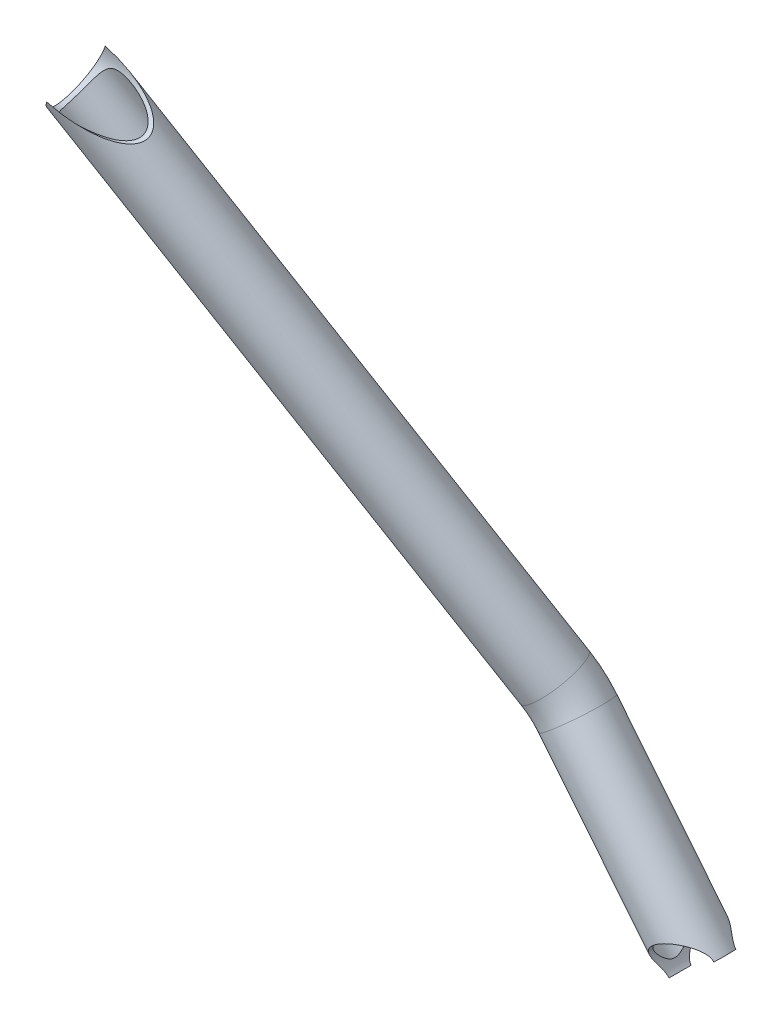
ISO-10303-21;
HEADER;
FILE_DESCRIPTION(('STEP AP214'),'2;1');
FILE_NAME('part.step','',(''),(''),'','','');
FILE_SCHEMA(('AUTOMOTIVE_DESIGN { 1 0 10303 214 1 1 1 1 }'));
ENDSEC;
DATA;
#1=APPLICATION_CONTEXT('core data for automotive mechanical design processes');
#2=APPLICATION_PROTOCOL_DEFINITION('international standard','automotive_design',2000,#1);
#3=PRODUCT_CONTEXT('',#1,'mechanical');
#4=PRODUCT('Part','Part','',(#3));
#5=PRODUCT_RELATED_PRODUCT_CATEGORY('part','',(#4));
#6=PRODUCT_DEFINITION_FORMATION('','',#4);
#7=PRODUCT_DEFINITION_CONTEXT('part definition',#1,'design');
#8=PRODUCT_DEFINITION('design','',#6,#7);
#9=PRODUCT_DEFINITION_SHAPE('','',#8);
#10=(LENGTH_UNIT() NAMED_UNIT(*) SI_UNIT(.MILLI.,.METRE.));
#11=(NAMED_UNIT(*) PLANE_ANGLE_UNIT() SI_UNIT($,.RADIAN.));
#12=(NAMED_UNIT(*) SI_UNIT($,.STERADIAN.) SOLID_ANGLE_UNIT());
#13=UNCERTAINTY_MEASURE_WITH_UNIT(LENGTH_MEASURE(1.E-05),#10,'distance_accuracy_value','');
#14=(GEOMETRIC_REPRESENTATION_CONTEXT(3) GLOBAL_UNCERTAINTY_ASSIGNED_CONTEXT((#13)) GLOBAL_UNIT_ASSIGNED_CONTEXT((#10,
#11,#12)) REPRESENTATION_CONTEXT('',''));
#15=CARTESIAN_POINT('',(0.,0.,0.));
#16=DIRECTION('',(0.,0.,1.));
#17=DIRECTION('',(1.,0.,0.));
#18=AXIS2_PLACEMENT_3D('',#15,#16,#17);
#19=CARTESIAN_POINT('',(-25.7347116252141,-142.314728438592,-164.226280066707));
#20=DIRECTION('',(-0.628585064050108,0.777740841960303,0.));
#21=DIRECTION('',(-0.777740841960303,-0.628585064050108,0.));
#22=AXIS2_PLACEMENT_3D('',#19,#20,#21);
#23=PLANE('',#22);
#24=CARTESIAN_POINT('',(-25.7347116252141,-142.314728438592,-164.226280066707));
#25=DIRECTION('',(-0.628585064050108,0.777740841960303,0.));
#26=DIRECTION('',(-0.777740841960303,-0.628585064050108,0.));
#27=AXIS2_PLACEMENT_3D('',#24,#25,#26);
#28=CIRCLE('',#27,15.);
#29=CARTESIAN_POINT('',(-36.6230834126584,-151.114919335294,-169.611444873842));
#30=VERTEX_POINT('',#29);
#31=CARTESIAN_POINT('',(-36.6230834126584,-151.114919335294,-158.841115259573));
#32=VERTEX_POINT('',#31);
#33=EDGE_CURVE('E104',#30,#32,#28,.T.);
#34=ORIENTED_EDGE('',*,*,#33,.F.);
#35=DIRECTION('',(0.,0.,1.));
#36=VECTOR('',#35,1.);
#37=CARTESIAN_POINT('',(-36.6230834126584,-151.114919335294,-179.226280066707));
#38=LINE('',#37,#36);
#39=EDGE_CURVE('E11',#30,#32,#38,.T.);
#40=ORIENTED_EDGE('',*,*,#39,.T.);
#41=EDGE_LOOP('',(#34,#40));
#42=FACE_BOUND('',#41,.T.);
#43=ADVANCED_FACE('F33',(#42),#23,.F.);
#44=CARTESIAN_POINT('',(-95.7836808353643,-55.6439699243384,-162.363586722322));
#45=DIRECTION('',(-0.609070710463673,0.753595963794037,0.247236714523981));
#46=DIRECTION('',(-0.777740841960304,-0.628585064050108,0.));
#47=AXIS2_PLACEMENT_3D('',#44,#45,#46);
#48=CYLINDRICAL_SURFACE('',#47,15.);
#49=CARTESIAN_POINT('',(-261.734711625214,149.685271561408,-94.9999999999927));
#50=DIRECTION('',(0.442113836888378,0.852264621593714,0.279607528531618));
#51=DIRECTION('',(-0.896958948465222,0.420083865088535,0.137819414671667));
#52=AXIS2_PLACEMENT_3D('',#49,#50,#51);
#53=ELLIPSE('',#52,33.9279134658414,15.);
#54=CARTESIAN_POINT('',(-261.734711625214,145.009346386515,-80.7474309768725));
#55=VERTEX_POINT('',#54);
#56=CARTESIAN_POINT('',(-261.734711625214,154.361196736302,-109.252569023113));
#57=VERTEX_POINT('',#56);
#58=EDGE_CURVE('E47',#55,#57,#53,.T.);
#59=ORIENTED_EDGE('',*,*,#58,.F.);
#60=CARTESIAN_POINT('',(-261.734711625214,149.685271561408,-94.9999999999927));
#61=DIRECTION('',(-0.896958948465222,0.420083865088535,0.137819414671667));
#62=DIRECTION('',(0.442113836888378,0.852264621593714,0.279607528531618));
#63=AXIS2_PLACEMENT_3D('',#60,#61,#62);
#64=ELLIPSE('',#63,16.7231733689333,15.);
#65=EDGE_CURVE('E65',#57,#55,#64,.T.);
#66=ORIENTED_EDGE('',*,*,#65,.F.);
#67=EDGE_LOOP('',(#59,#66));
#68=FACE_BOUND('',#67,.T.);
#69=CARTESIAN_POINT('',(-95.7836808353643,-55.6439699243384,-162.363586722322));
#70=DIRECTION('',(-0.609070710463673,0.753595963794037,0.247236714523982));
#71=DIRECTION('',(-0.777740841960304,-0.628585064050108,0.));
#72=AXIS2_PLACEMENT_3D('',#69,#70,#71);
#73=CIRCLE('',#72,15.);
#74=CARTESIAN_POINT('',(-98.1148204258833,-52.7596785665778,-176.897913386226));
#75=VERTEX_POINT('',#74);
#76=EDGE_CURVE('E156',#75,#75,#73,.T.);
#77=ORIENTED_EDGE('',*,*,#76,.T.);
#78=EDGE_LOOP('',(#77));
#79=FACE_BOUND('',#78,.T.);
#80=ADVANCED_FACE('F35',(#68,#79),#48,.T.);
#81=CARTESIAN_POINT('',(-95.7836808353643,-55.6439699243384,-162.363586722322));
#82=DIRECTION('',(-0.609070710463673,0.753595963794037,0.247236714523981));
#83=DIRECTION('',(-0.777740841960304,-0.628585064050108,0.));
#84=AXIS2_PLACEMENT_3D('',#81,#82,#83);
#85=CYLINDRICAL_SURFACE('',#84,13.);
#86=CARTESIAN_POINT('',(-266.456125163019,134.845650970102,-97.1876153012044));
#87=CARTESIAN_POINT('',(-266.413491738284,134.792905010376,-96.8297945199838));
#88=CARTESIAN_POINT('',(-266.361830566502,134.75325889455,-96.4710366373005));
#89=CARTESIAN_POINT('',(-266.240600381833,134.699945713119,-95.7544647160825));
#90=CARTESIAN_POINT('',(-266.171021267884,134.686293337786,-95.3966513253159));
#91=CARTESIAN_POINT('',(-266.013942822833,134.684358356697,-94.6840637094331));
#92=CARTESIAN_POINT('',(-265.9264034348,134.69613303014,-94.3292981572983));
#93=CARTESIAN_POINT('',(-265.73361641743,134.744146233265,-93.6263669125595));
#94=CARTESIAN_POINT('',(-265.628371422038,134.780381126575,-93.2782002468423));
#95=CARTESIAN_POINT('',(-265.400460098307,134.875783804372,-92.59194144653));
#96=CARTESIAN_POINT('',(-265.277843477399,134.934886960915,-92.2538237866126));
#97=CARTESIAN_POINT('',(-265.014732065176,135.074284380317,-91.5890789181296));
#98=CARTESIAN_POINT('',(-264.874235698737,135.154580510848,-91.2624527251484));
#99=CARTESIAN_POINT('',(-264.574881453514,135.334182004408,-90.6231927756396));
#100=CARTESIAN_POINT('',(-264.416025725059,135.433485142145,-90.3105573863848));
#101=CARTESIAN_POINT('',(-264.079057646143,135.648438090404,-89.7017509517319));
#102=CARTESIAN_POINT('',(-263.900948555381,135.764085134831,-89.4055771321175));
#103=CARTESIAN_POINT('',(-263.555884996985,135.98777237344,-88.8807152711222));
#104=CARTESIAN_POINT('',(-263.392116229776,136.093805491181,-88.6490704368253));
#105=CARTESIAN_POINT('',(-263.049202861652,136.312479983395,-88.2006896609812));
#106=CARTESIAN_POINT('',(-262.870057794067,136.425121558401,-87.9839541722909));
#107=CARTESIAN_POINT('',(-262.495374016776,136.653868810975,-87.5677153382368));
#108=CARTESIAN_POINT('',(-262.299859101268,136.769969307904,-87.368187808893));
#109=CARTESIAN_POINT('',(-261.890853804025,137.002056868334,-86.988413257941));
#110=CARTESIAN_POINT('',(-261.677370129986,137.118043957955,-86.8081590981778));
#111=CARTESIAN_POINT('',(-261.292014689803,137.314394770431,-86.5156910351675));
#112=CARTESIAN_POINT('',(-261.124622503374,137.395865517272,-86.3983075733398));
#113=CARTESIAN_POINT('',(-260.779571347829,137.554278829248,-86.1763050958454));
#114=CARTESIAN_POINT('',(-260.601915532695,137.631222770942,-86.0716821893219));
#115=CARTESIAN_POINT('',(-260.236862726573,137.778331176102,-85.876420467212));
#116=CARTESIAN_POINT('',(-260.04948512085,137.848508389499,-85.7857551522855));
#117=CARTESIAN_POINT('',(-259.66540436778,137.980210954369,-85.6190160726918));
#118=CARTESIAN_POINT('',(-259.468701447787,138.041736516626,-85.5429419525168));
#119=CARTESIAN_POINT('',(-259.06640702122,138.154679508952,-85.4055532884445));
#120=CARTESIAN_POINT('',(-258.860781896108,138.20605375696,-85.3443015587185));
#121=CARTESIAN_POINT('',(-258.443147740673,138.297267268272,-85.2368891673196));
#122=CARTESIAN_POINT('',(-258.231138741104,138.337106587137,-85.1907284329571));
#123=CARTESIAN_POINT('',(-257.80241461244,138.404926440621,-85.1128117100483));
#124=CARTESIAN_POINT('',(-257.585694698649,138.432894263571,-85.0810711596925));
#125=CARTESIAN_POINT('',(-257.149562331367,138.477257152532,-85.0309725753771));
#126=CARTESIAN_POINT('',(-256.930149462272,138.493650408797,-85.0126166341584));
#127=CARTESIAN_POINT('',(-256.390030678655,138.520719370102,-84.9823433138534));
#128=CARTESIAN_POINT('',(-256.068645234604,138.525402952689,-84.9771520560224));
#129=CARTESIAN_POINT('',(-255.426547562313,138.515657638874,-84.9880230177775));
#130=CARTESIAN_POINT('',(-255.105835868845,138.501217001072,-85.0040982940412));
#131=CARTESIAN_POINT('',(-254.465541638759,138.456923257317,-85.053880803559));
#132=CARTESIAN_POINT('',(-254.145970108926,138.427003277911,-85.0876645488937));
#133=CARTESIAN_POINT('',(-253.510241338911,138.355109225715,-85.1699241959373));
#134=CARTESIAN_POINT('',(-253.1940834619,138.313137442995,-85.2183973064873));
#135=CARTESIAN_POINT('',(-252.448232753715,138.202601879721,-85.3481613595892));
#136=CARTESIAN_POINT('',(-252.0201126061,138.129956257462,-85.4349511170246));
#137=CARTESIAN_POINT('',(-251.170409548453,137.972825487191,-85.6280142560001));
#138=CARTESIAN_POINT('',(-250.748829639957,137.888335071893,-85.7342963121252));
#139=CARTESIAN_POINT('',(-249.911307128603,137.711428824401,-85.964062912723));
#140=CARTESIAN_POINT('',(-249.495375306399,137.618999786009,-86.0875763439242));
#141=CARTESIAN_POINT('',(-248.669649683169,137.429404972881,-86.3501463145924));
#142=CARTESIAN_POINT('',(-248.259854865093,137.33223999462,-86.4892002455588));
#143=CARTESIAN_POINT('',(-247.445634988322,137.135387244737,-86.782237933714));
#144=CARTESIAN_POINT('',(-247.04121753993,137.035696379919,-86.9362407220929));
#145=CARTESIAN_POINT('',(-246.238280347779,136.835827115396,-87.258696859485));
#146=CARTESIAN_POINT('',(-245.839760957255,136.735648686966,-87.427151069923));
#147=CARTESIAN_POINT('',(-245.049317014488,136.536573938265,-87.7783341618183));
#148=CARTESIAN_POINT('',(-244.657385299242,136.437676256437,-87.9610461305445));
#149=CARTESIAN_POINT('',(-243.880120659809,136.242554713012,-88.3412446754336));
#150=CARTESIAN_POINT('',(-243.494787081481,136.146330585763,-88.5387297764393));
#151=CARTESIAN_POINT('',(-242.675917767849,135.944326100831,-88.9789274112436));
#152=CARTESIAN_POINT('',(-242.243509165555,135.839187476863,-89.224042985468));
#153=CARTESIAN_POINT('',(-241.389683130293,135.636588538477,-89.735940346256));
#154=CARTESIAN_POINT('',(-240.968267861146,135.539129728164,-90.0027263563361));
#155=CARTESIAN_POINT('',(-240.139727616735,135.354695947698,-90.5592355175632));
#156=CARTESIAN_POINT('',(-239.732574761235,135.267699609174,-90.8489098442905));
#157=CARTESIAN_POINT('',(-238.935143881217,135.107069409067,-91.4540073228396));
#158=CARTESIAN_POINT('',(-238.544859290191,135.033430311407,-91.769420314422));
#159=CARTESIAN_POINT('',(-237.915615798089,134.925618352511,-92.3164242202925));
#160=CARTESIAN_POINT('',(-237.67044623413,134.886551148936,-92.5399119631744));
#161=CARTESIAN_POINT('',(-237.191599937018,134.81733519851,-93.0003261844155));
#162=CARTESIAN_POINT('',(-236.957924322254,134.787187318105,-93.2372539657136));
#163=CARTESIAN_POINT('',(-236.504953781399,134.737529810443,-93.7252024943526));
#164=CARTESIAN_POINT('',(-236.285645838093,134.718010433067,-93.9762100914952));
#165=CARTESIAN_POINT('',(-235.864680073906,134.691600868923,-94.4932460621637));
#166=CARTESIAN_POINT('',(-235.663014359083,134.684705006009,-94.7592676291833));
#167=CARTESIAN_POINT('',(-235.345177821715,134.685710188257,-95.2156803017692));
#168=CARTESIAN_POINT('',(-235.222871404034,134.689454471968,-95.4018164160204));
#169=CARTESIAN_POINT('',(-234.989692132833,134.704412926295,-95.7809399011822));
#170=CARTESIAN_POINT('',(-234.878821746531,134.71562870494,-95.9739287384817));
#171=CARTESIAN_POINT('',(-234.670523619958,134.7463192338,-96.3661426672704));
#172=CARTESIAN_POINT('',(-234.573080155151,134.765784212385,-96.5653601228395));
#173=CARTESIAN_POINT('',(-234.39355576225,134.813736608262,-96.9694652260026));
#174=CARTESIAN_POINT('',(-234.311465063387,134.842218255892,-97.1743491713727));
#175=CARTESIAN_POINT('',(-234.177976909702,134.902813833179,-97.5511707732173));
#176=CARTESIAN_POINT('',(-234.123713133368,134.933334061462,-97.7223501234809));
#177=CARTESIAN_POINT('',(-234.027943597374,135.00109330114,-98.0668716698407));
#178=CARTESIAN_POINT('',(-233.98643167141,135.038329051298,-98.2402127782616));
#179=CARTESIAN_POINT('',(-233.917093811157,135.119611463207,-98.5879530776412));
#180=CARTESIAN_POINT('',(-233.889260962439,135.163654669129,-98.7623516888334));
#181=CARTESIAN_POINT('',(-233.847939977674,135.258488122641,-99.1110286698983));
#182=CARTESIAN_POINT('',(-233.834451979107,135.309278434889,-99.2853070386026));
#183=CARTESIAN_POINT('',(-233.822160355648,135.417469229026,-99.6328195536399));
#184=CARTESIAN_POINT('',(-233.823394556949,135.47488636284,-99.8060498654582));
#185=CARTESIAN_POINT('',(-233.840605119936,135.595757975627,-100.149638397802));
#186=CARTESIAN_POINT('',(-233.856581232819,135.659212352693,-100.319996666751));
#187=CARTESIAN_POINT('',(-233.902869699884,135.791581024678,-100.656686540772));
#188=CARTESIAN_POINT('',(-233.933189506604,135.860498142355,-100.823016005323));
#189=CARTESIAN_POINT('',(-234.007422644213,136.003066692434,-101.150544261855));
#190=CARTESIAN_POINT('',(-234.051338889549,136.076719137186,-101.311741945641));
#191=CARTESIAN_POINT('',(-234.162585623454,136.244274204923,-101.662203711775));
#192=CARTESIAN_POINT('',(-234.232918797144,136.339129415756,-101.850062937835));
#193=CARTESIAN_POINT('',(-234.390186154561,136.533450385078,-102.216135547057));
#194=CARTESIAN_POINT('',(-234.477123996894,136.632917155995,-102.394346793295));
#195=CARTESIAN_POINT('',(-234.760018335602,136.936805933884,-102.914408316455));
#196=CARTESIAN_POINT('',(-234.977948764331,137.146561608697,-103.241368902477));
#197=CARTESIAN_POINT('',(-235.403943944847,137.525616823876,-103.787942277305));
#198=CARTESIAN_POINT('',(-235.603570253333,137.693627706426,-104.015320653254));
#199=CARTESIAN_POINT('',(-236.02374873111,138.031796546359,-104.448383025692));
#200=CARTESIAN_POINT('',(-236.244313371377,138.201955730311,-104.654053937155));
#201=CARTESIAN_POINT('',(-236.70228989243,138.543021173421,-105.045787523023));
#202=CARTESIAN_POINT('',(-236.939727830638,138.713928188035,-105.231818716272));
#203=CARTESIAN_POINT('',(-237.428000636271,139.055269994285,-105.586007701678));
#204=CARTESIAN_POINT('',(-237.678840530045,139.225704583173,-105.754158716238));
#205=CARTESIAN_POINT('',(-238.178398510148,139.556708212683,-106.066222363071));
#206=CARTESIAN_POINT('',(-238.426581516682,139.717340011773,-106.210930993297));
#207=CARTESIAN_POINT('',(-238.931092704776,140.036982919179,-106.487172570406));
#208=CARTESIAN_POINT('',(-239.187419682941,140.195994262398,-106.618707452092));
#209=CARTESIAN_POINT('',(-239.707246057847,140.512204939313,-106.869947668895));
#210=CARTESIAN_POINT('',(-239.970751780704,140.669402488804,-106.989642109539));
#211=CARTESIAN_POINT('',(-240.503753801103,140.981543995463,-107.218123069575));
#212=CARTESIAN_POINT('',(-240.773250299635,141.136487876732,-107.326909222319));
#213=CARTESIAN_POINT('',(-241.318263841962,141.444294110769,-107.534786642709));
#214=CARTESIAN_POINT('',(-241.593796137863,141.597149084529,-107.633848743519));
#215=CARTESIAN_POINT('',(-242.149550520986,141.900062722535,-107.822729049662));
#216=CARTESIAN_POINT('',(-242.429773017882,142.050121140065,-107.91254644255));
#217=CARTESIAN_POINT('',(-242.994281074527,142.347075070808,-108.083585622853));
#218=CARTESIAN_POINT('',(-243.27856447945,142.493972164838,-108.164811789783));
#219=CARTESIAN_POINT('',(-243.850991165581,142.784380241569,-108.319337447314));
#220=CARTESIAN_POINT('',(-244.139134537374,142.927891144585,-108.392636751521));
#221=CARTESIAN_POINT('',(-244.757539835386,143.229993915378,-108.54109871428));
#222=CARTESIAN_POINT('',(-245.08831170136,143.388056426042,-108.615215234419));
#223=CARTESIAN_POINT('',(-245.754219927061,143.698776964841,-108.754667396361));
#224=CARTESIAN_POINT('',(-246.08935637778,143.851434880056,-108.820002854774));
#225=CARTESIAN_POINT('',(-246.764070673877,144.150681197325,-108.942541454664));
#226=CARTESIAN_POINT('',(-247.103651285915,144.297265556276,-108.999739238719));
#227=CARTESIAN_POINT('',(-247.786993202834,144.583285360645,-109.106488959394));
#228=CARTESIAN_POINT('',(-248.130754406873,144.722720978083,-109.156041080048));
#229=CARTESIAN_POINT('',(-248.821498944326,144.992789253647,-109.247837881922));
#230=CARTESIAN_POINT('',(-249.168469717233,145.123446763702,-109.290103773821));
#231=CARTESIAN_POINT('',(-249.866807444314,145.374782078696,-109.367914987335));
#232=CARTESIAN_POINT('',(-250.218174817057,145.495458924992,-109.403459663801));
#233=CARTESIAN_POINT('',(-250.925092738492,145.724506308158,-109.468119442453));
#234=CARTESIAN_POINT('',(-251.280638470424,145.832889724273,-109.497241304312));
#235=CARTESIAN_POINT('',(-251.99639282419,146.034534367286,-109.549328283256));
#236=CARTESIAN_POINT('',(-252.356600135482,146.127799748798,-109.572295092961));
#237=CARTESIAN_POINT('',(-253.008919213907,146.278391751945,-109.608145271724));
#238=CARTESIAN_POINT('',(-253.300167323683,146.339174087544,-109.622127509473));
#239=CARTESIAN_POINT('',(-253.885624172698,146.445857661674,-109.646132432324));
#240=CARTESIAN_POINT('',(-254.17983320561,146.491757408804,-109.656154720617));
#241=CARTESIAN_POINT('',(-254.770177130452,146.565273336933,-109.671981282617));
#242=CARTESIAN_POINT('',(-255.066307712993,146.592921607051,-109.677792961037));
#243=CARTESIAN_POINT('',(-255.659892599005,146.626078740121,-109.684743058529));
#244=CARTESIAN_POINT('',(-255.957346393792,146.631595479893,-109.685883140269));
#245=CARTESIAN_POINT('',(-256.475543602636,146.618135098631,-109.683074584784));
#246=CARTESIAN_POINT('',(-256.69644292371,146.605063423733,-109.680353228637));
#247=CARTESIAN_POINT('',(-257.136616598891,146.562557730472,-109.671371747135));
#248=CARTESIAN_POINT('',(-257.355891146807,146.533125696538,-109.665112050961));
#249=CARTESIAN_POINT('',(-257.790820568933,146.456617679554,-109.648458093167));
#250=CARTESIAN_POINT('',(-258.00648115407,146.40957296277,-109.638071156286));
#251=CARTESIAN_POINT('',(-258.432698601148,146.297151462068,-109.612459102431));
#252=CARTESIAN_POINT('',(-258.643255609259,146.231775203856,-109.597234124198));
#253=CARTESIAN_POINT('',(-259.058226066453,146.082587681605,-109.561132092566));
#254=CARTESIAN_POINT('',(-259.262610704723,145.998701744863,-109.540232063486));
#255=CARTESIAN_POINT('',(-259.662685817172,145.813798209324,-109.492094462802));
#256=CARTESIAN_POINT('',(-259.85837612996,145.712780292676,-109.46485677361));
#257=CARTESIAN_POINT('',(-260.240282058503,145.495304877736,-109.403365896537));
#258=CARTESIAN_POINT('',(-260.426479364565,145.378818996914,-109.369099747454));
#259=CARTESIAN_POINT('',(-260.788467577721,145.132868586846,-109.293082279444));
#260=CARTESIAN_POINT('',(-260.96425680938,145.003401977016,-109.251329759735));
#261=CARTESIAN_POINT('',(-261.356650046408,144.693385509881,-109.1462097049));
#262=CARTESIAN_POINT('',(-261.569637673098,144.50917905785,-109.08011751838));
#263=CARTESIAN_POINT('',(-261.978598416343,144.127873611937,-108.934025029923));
#264=CARTESIAN_POINT('',(-262.174565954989,143.930770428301,-108.854020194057));
#265=CARTESIAN_POINT('',(-262.550951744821,143.527583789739,-108.679591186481));
#266=CARTESIAN_POINT('',(-262.731340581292,143.321484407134,-108.585140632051));
#267=CARTESIAN_POINT('',(-263.077359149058,142.904185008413,-108.381733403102));
#268=CARTESIAN_POINT('',(-263.242988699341,142.69298492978,-108.272776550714));
#269=CARTESIAN_POINT('',(-263.60451745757,142.209647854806,-108.008091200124));
#270=CARTESIAN_POINT('',(-263.796124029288,141.936808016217,-107.847760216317));
#271=CARTESIAN_POINT('',(-264.158839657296,141.392469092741,-107.503330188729));
#272=CARTESIAN_POINT('',(-264.329944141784,141.120970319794,-107.319225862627));
#273=CARTESIAN_POINT('',(-264.652757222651,140.583523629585,-106.927644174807));
#274=CARTESIAN_POINT('',(-264.804472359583,140.317573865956,-106.720174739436));
#275=CARTESIAN_POINT('',(-265.089281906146,139.794686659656,-106.28240232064));
#276=CARTESIAN_POINT('',(-265.222377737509,139.537748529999,-106.052101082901));
#277=CARTESIAN_POINT('',(-265.470790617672,139.035072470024,-105.568600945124));
#278=CARTESIAN_POINT('',(-265.586039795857,138.789379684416,-105.315320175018));
#279=CARTESIAN_POINT('',(-265.798277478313,138.313098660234,-104.787746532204));
#280=CARTESIAN_POINT('',(-265.895265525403,138.082510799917,-104.51345313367));
#281=CARTESIAN_POINT('',(-266.070942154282,137.639027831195,-103.94527343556));
#282=CARTESIAN_POINT('',(-266.149626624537,137.426136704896,-103.651382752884));
#283=CARTESIAN_POINT('',(-266.288517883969,137.020494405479,-103.045880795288));
#284=CARTESIAN_POINT('',(-266.348725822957,136.827741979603,-102.734270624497));
#285=CARTESIAN_POINT('',(-266.449366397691,136.468495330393,-102.102529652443));
#286=CARTESIAN_POINT('',(-266.490208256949,136.301513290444,-101.782741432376));
#287=CARTESIAN_POINT('',(-266.553927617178,135.990441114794,-101.130431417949));
#288=CARTESIAN_POINT('',(-266.57680293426,135.846353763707,-100.797908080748));
#289=CARTESIAN_POINT('',(-266.604462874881,135.582711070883,-100.123346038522));
#290=CARTESIAN_POINT('',(-266.60928469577,135.463105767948,-99.781328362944));
#291=CARTESIAN_POINT('',(-266.600918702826,135.249075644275,-99.0898781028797));
#292=CARTESIAN_POINT('',(-266.587740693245,135.154637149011,-98.7404496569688));
#293=CARTESIAN_POINT('',(-266.553077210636,135.02690733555,-98.1896926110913));
#294=CARTESIAN_POINT('',(-266.537684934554,134.984872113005,-97.9899496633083));
#295=CARTESIAN_POINT('',(-266.501186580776,134.909063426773,-97.5894414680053));
#296=CARTESIAN_POINT('',(-266.480081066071,134.875289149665,-97.3886763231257));
#297=CARTESIAN_POINT('',(-266.456125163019,134.845650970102,-97.1876153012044));
#298=B_SPLINE_CURVE_WITH_KNOTS('',3,(#86,#87,#88,#89,#90,#91,#92,#93,#94,#95,#96,#97,#98,#99,
#100,#101,#102,#103,#104,#105,#106,#107,#108,#109,#110,#111,#112,#113,#114,#115,#116,#117,#118,
#119,#120,#121,#122,#123,#124,#125,#126,#127,#128,#129,#130,#131,#132,#133,#134,#135,#136,#137,
#138,#139,#140,#141,#142,#143,#144,#145,#146,#147,#148,#149,#150,#151,#152,#153,#154,#155,#156,
#157,#158,#159,#160,#161,#162,#163,#164,#165,#166,#167,#168,#169,#170,#171,#172,#173,#174,#175,
#176,#177,#178,#179,#180,#181,#182,#183,#184,#185,#186,#187,#188,#189,#190,#191,#192,#193,#194,
#195,#196,#197,#198,#199,#200,#201,#202,#203,#204,#205,#206,#207,#208,#209,#210,#211,#212,#213,
#214,#215,#216,#217,#218,#219,#220,#221,#222,#223,#224,#225,#226,#227,#228,#229,#230,#231,#232,
#233,#234,#235,#236,#237,#238,#239,#240,#241,#242,#243,#244,#245,#246,#247,#248,#249,#250,#251,
#252,#253,#254,#255,#256,#257,#258,#259,#260,#261,#262,#263,#264,#265,#266,#267,#268,#269,#270,
#271,#272,#273,#274,#275,#276,#277,#278,#279,#280,#281,#282,#283,#284,#285,#286,#287,#288,#289,
#290,#291,#292,#293,#294,#295,#296,#297),.UNSPECIFIED.,.T.,.F.,(4,2,2,2,2,2,2,2,2,2,2,2,2,2,2,2,
2,2,2,2,2,2,2,2,2,2,2,2,2,2,2,2,2,2,2,2,2,2,2,2,2,2,2,2,2,2,2,2,2,2,2,2,2,2,2,2,2,2,2,2,2,2,2,2,
2,2,2,2,2,2,2,2,2,2,2,2,2,2,2,2,2,2,2,2,2,2,2,2,2,2,2,2,2,2,2,2,2,2,2,2,2,2,2,2,2,4),(0.,
1.0923730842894,2.18536333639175,3.28081832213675,4.37611048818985,5.46832959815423,
6.56064499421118,7.65283258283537,8.7448355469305,9.65264983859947,10.560491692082,
11.467036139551,12.3732436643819,13.0329184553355,13.6923915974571,14.3505968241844,
15.008786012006,15.6697174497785,16.3306457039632,16.9922798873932,17.6540174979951,
18.616743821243,19.5800614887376,20.5475760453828,21.5149068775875,22.8425333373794,
24.1707520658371,25.5012247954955,26.8314745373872,28.1634405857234,29.4954860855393,
30.8259748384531,32.1563309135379,33.6798981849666,35.2037631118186,36.7244608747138,
38.244561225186,39.2461920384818,40.247920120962,41.2487277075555,42.2490851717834,
42.9169050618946,43.5848687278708,44.2520433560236,44.9187919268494,45.4647074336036,
46.0103585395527,46.5557335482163,47.1011137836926,47.6478955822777,48.1946681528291,
48.7417251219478,49.2888994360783,49.9535537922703,50.6183547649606,51.9490498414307,
52.9860491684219,54.0236700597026,55.0629297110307,56.1025819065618,57.0896186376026,
58.0765101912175,59.0643015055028,60.0521260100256,61.0428282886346,62.0336175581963,
63.0238992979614,64.0142043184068,65.1360722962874,66.2579637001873,67.3805903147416,
68.5031899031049,69.6224642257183,70.741845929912,71.8600438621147,72.9779339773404,
73.871155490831,74.7644664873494,75.6562026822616,76.5476214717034,77.2109784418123,
77.8742549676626,78.5363595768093,79.1984452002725,79.8632523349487,80.5280718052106,
81.1941284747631,81.8602920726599,82.7267139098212,83.593418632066,84.4617255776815,
85.3300431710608,86.4384427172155,87.5470889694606,88.6553602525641,89.7635468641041,
90.8758495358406,91.9881800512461,93.1007601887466,94.2132710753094,95.3010917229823,
96.3890445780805,97.4747545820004,98.5598734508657,99.1737430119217,99.7875521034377),.UNSPECIFIED.);
#299=CARTESIAN_POINT('',(-266.456125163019,134.845650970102,-97.1876153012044));
#300=VERTEX_POINT('',#299);
#301=EDGE_CURVE('E69',#300,#300,#298,.T.);
#302=ORIENTED_EDGE('',*,*,#301,.T.);
#303=EDGE_LOOP('',(#302));
#304=FACE_BOUND('',#303,.T.);
#305=CARTESIAN_POINT('',(-95.7836808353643,-55.6439699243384,-162.363586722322));
#306=DIRECTION('',(-0.609070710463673,0.753595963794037,0.247236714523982));
#307=DIRECTION('',(-0.777740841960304,-0.628585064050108,0.));
#308=AXIS2_PLACEMENT_3D('',#305,#306,#307);
#309=CIRCLE('',#308,13.);
#310=CARTESIAN_POINT('',(-97.8040018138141,-53.1442507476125,-174.960003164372));
#311=VERTEX_POINT('',#310);
#312=EDGE_CURVE('E153',#311,#311,#309,.T.);
#313=ORIENTED_EDGE('',*,*,#312,.F.);
#314=EDGE_LOOP('',(#313));
#315=FACE_BOUND('',#314,.T.);
#316=ADVANCED_FACE('F118',(#304,#315),#85,.F.);
#317=CARTESIAN_POINT('',(-86.4591224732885,-67.1811353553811,-104.226280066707));
#318=DIRECTION('',(0.777740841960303,0.628585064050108,0.));
#319=DIRECTION('',(-0.628585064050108,0.777740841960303,0.));
#320=AXIS2_PLACEMENT_3D('',#317,#318,#319);
#321=TOROIDAL_SURFACE('',#320,60.0000000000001,15.);
#322=CARTESIAN_POINT('',(-86.4591224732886,-67.1811353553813,-164.226280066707));
#323=DIRECTION('',(-0.628585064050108,0.777740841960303,0.));
#324=DIRECTION('',(-0.777740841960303,-0.628585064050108,0.));
#325=AXIS2_PLACEMENT_3D('',#322,#323,#324);
#326=CIRCLE('',#325,15.);
#327=CARTESIAN_POINT('',(-86.4591224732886,-67.1811353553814,-179.226280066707));
#328=VERTEX_POINT('',#327);
#329=EDGE_CURVE('E150',#328,#328,#326,.T.);
#330=CARTESIAN_POINT('',(-86.4591224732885,-67.1811353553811,-104.226280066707));
#331=DIRECTION('',(0.777740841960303,0.628585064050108,0.));
#332=DIRECTION('',(-0.628585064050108,0.777740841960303,0.));
#333=AXIS2_PLACEMENT_3D('',#330,#331,#332);
#334=CIRCLE('',#333,75.0000000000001);
#335=EDGE_CURVE('',#328,#75,#334,.T.);
#336=ORIENTED_EDGE('',*,*,#329,.T.);
#337=ORIENTED_EDGE('',*,*,#76,.F.);
#338=ORIENTED_EDGE('',*,*,#335,.T.);
#339=ORIENTED_EDGE('',*,*,#335,.F.);
#340=EDGE_LOOP('',(#336,#338,#337,#339));
#341=FACE_BOUND('',#340,.T.);
#342=ADVANCED_FACE('F115',(#341),#321,.T.);
#343=CARTESIAN_POINT('',(-86.4591224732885,-67.1811353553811,-104.226280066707));
#344=DIRECTION('',(0.777740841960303,0.628585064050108,0.));
#345=DIRECTION('',(-0.628585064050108,0.777740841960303,0.));
#346=AXIS2_PLACEMENT_3D('',#343,#344,#345);
#347=TOROIDAL_SURFACE('',#346,60.0000000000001,13.);
#348=CARTESIAN_POINT('',(-86.4591224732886,-67.1811353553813,-164.226280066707));
#349=DIRECTION('',(-0.628585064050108,0.777740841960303,0.));
#350=DIRECTION('',(-0.777740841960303,-0.628585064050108,0.));
#351=AXIS2_PLACEMENT_3D('',#348,#349,#350);
#352=CIRCLE('',#351,13.);
#353=CARTESIAN_POINT('',(-86.4591224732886,-67.1811353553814,-177.226280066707));
#354=VERTEX_POINT('',#353);
#355=EDGE_CURVE('E105',#354,#354,#352,.T.);
#356=CARTESIAN_POINT('',(-86.4591224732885,-67.1811353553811,-104.226280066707));
#357=DIRECTION('',(0.777740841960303,0.628585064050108,0.));
#358=DIRECTION('',(-0.628585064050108,0.777740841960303,0.));
#359=AXIS2_PLACEMENT_3D('',#356,#357,#358);
#360=CIRCLE('',#359,73.0000000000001);
#361=EDGE_CURVE('',#354,#311,#360,.T.);
#362=ORIENTED_EDGE('',*,*,#355,.F.);
#363=ORIENTED_EDGE('',*,*,#312,.T.);
#364=ORIENTED_EDGE('',*,*,#361,.T.);
#365=ORIENTED_EDGE('',*,*,#361,.F.);
#366=EDGE_LOOP('',(#362,#364,#363,#365));
#367=FACE_BOUND('',#366,.T.);
#368=ADVANCED_FACE('F111',(#367),#347,.F.);
#369=CARTESIAN_POINT('',(-86.4591224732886,-67.1811353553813,-164.226280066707));
#370=DIRECTION('',(0.628585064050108,-0.777740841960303,0.));
#371=DIRECTION('',(0.777740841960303,0.628585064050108,0.));
#372=AXIS2_PLACEMENT_3D('',#369,#370,#371);
#373=CYLINDRICAL_SURFACE('',#372,13.);
#374=CARTESIAN_POINT('',(-18.8903044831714,-130.101862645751,-164.226280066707));
#375=CARTESIAN_POINT('',(-18.890311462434,-130.101857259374,-164.402565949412));
#376=CARTESIAN_POINT('',(-18.898785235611,-130.097097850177,-164.578900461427));
#377=CARTESIAN_POINT('',(-18.9321418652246,-130.078495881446,-164.929601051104));
#378=CARTESIAN_POINT('',(-18.9570378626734,-130.064646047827,-165.103965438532));
#379=CARTESIAN_POINT('',(-19.0218859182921,-130.02899162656,-165.449725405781));
#380=CARTESIAN_POINT('',(-19.0618985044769,-130.007155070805,-165.621106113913));
#381=CARTESIAN_POINT('',(-19.1550475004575,-129.95710675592,-165.959346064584));
#382=CARTESIAN_POINT('',(-19.2081920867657,-129.928891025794,-166.126202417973));
#383=CARTESIAN_POINT('',(-19.3569274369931,-129.85141806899,-166.542658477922));
#384=CARTESIAN_POINT('',(-19.4600449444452,-129.798961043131,-166.788963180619));
#385=CARTESIAN_POINT('',(-19.6865255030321,-129.687956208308,-167.270624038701));
#386=CARTESIAN_POINT('',(-19.8099047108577,-129.629403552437,-167.505971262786));
#387=CARTESIAN_POINT('',(-20.0729998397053,-129.509808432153,-167.967560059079));
#388=CARTESIAN_POINT('',(-20.212762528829,-129.448759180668,-168.193772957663));
#389=CARTESIAN_POINT('',(-20.5054346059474,-129.327049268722,-168.637683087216));
#390=CARTESIAN_POINT('',(-20.6583483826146,-129.266388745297,-168.855377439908));
#391=CARTESIAN_POINT('',(-20.967351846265,-129.150453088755,-169.272500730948));
#392=CARTESIAN_POINT('',(-21.1229010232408,-129.095060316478,-169.472298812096));
#393=CARTESIAN_POINT('',(-21.4428170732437,-128.987757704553,-169.86568930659));
#394=CARTESIAN_POINT('',(-21.6071852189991,-128.935848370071,-170.059280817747));
#395=CARTESIAN_POINT('',(-22.1123241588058,-128.786927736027,-170.631630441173));
#396=CARTESIAN_POINT('',(-22.4649958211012,-128.69677530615,-171.001786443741));
#397=CARTESIAN_POINT('',(-23.1965146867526,-128.541658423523,-171.71981250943));
#398=CARTESIAN_POINT('',(-23.5753275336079,-128.476661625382,-172.067710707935));
#399=CARTESIAN_POINT('',(-24.3561762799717,-128.377210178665,-172.740870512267));
#400=CARTESIAN_POINT('',(-24.758198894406,-128.342738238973,-173.066144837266));
#401=CARTESIAN_POINT('',(-25.4756481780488,-128.313789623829,-173.610606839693));
#402=CARTESIAN_POINT('',(-25.7864940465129,-128.311259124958,-173.835430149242));
#403=CARTESIAN_POINT('',(-26.4181092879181,-128.327851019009,-174.269949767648));
#404=CARTESIAN_POINT('',(-26.7388786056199,-128.346973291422,-174.479646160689));
#405=CARTESIAN_POINT('',(-27.3883042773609,-128.408906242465,-174.881716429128));
#406=CARTESIAN_POINT('',(-27.7169489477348,-128.451683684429,-175.074114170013));
#407=CARTESIAN_POINT('',(-28.3805843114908,-128.562911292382,-175.43960831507));
#408=CARTESIAN_POINT('',(-28.7155735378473,-128.63135559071,-175.612709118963));
#409=CARTESIAN_POINT('',(-29.3203067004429,-128.778867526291,-175.903735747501));
#410=CARTESIAN_POINT('',(-29.5893470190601,-128.852880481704,-176.025697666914));
#411=CARTESIAN_POINT('',(-30.1283085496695,-129.019023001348,-176.254330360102));
#412=CARTESIAN_POINT('',(-30.3982295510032,-129.111148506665,-176.361004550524));
#413=CARTESIAN_POINT('',(-30.9371045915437,-129.314037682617,-176.557584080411));
#414=CARTESIAN_POINT('',(-31.2060589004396,-129.424795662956,-176.64749452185));
#415=CARTESIAN_POINT('',(-31.7410075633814,-129.665207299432,-176.809157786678));
#416=CARTESIAN_POINT('',(-32.0070018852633,-129.794861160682,-176.880910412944));
#417=CARTESIAN_POINT('',(-32.5355864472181,-130.073893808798,-177.00540534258));
#418=CARTESIAN_POINT('',(-32.7981391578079,-130.223405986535,-177.058009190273));
#419=CARTESIAN_POINT('',(-33.3153932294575,-130.54080277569,-177.1424311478));
#420=CARTESIAN_POINT('',(-33.5700945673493,-130.708687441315,-177.174249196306));
#421=CARTESIAN_POINT('',(-34.0690329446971,-131.06162106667,-177.216407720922));
#422=CARTESIAN_POINT('',(-34.3132741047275,-131.246663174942,-177.226756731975));
#423=CARTESIAN_POINT('',(-34.7890336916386,-131.632359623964,-177.225769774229));
#424=CARTESIAN_POINT('',(-35.020553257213,-131.833012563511,-177.214435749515));
#425=CARTESIAN_POINT('',(-35.4436247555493,-132.224607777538,-177.172826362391));
#426=CARTESIAN_POINT('',(-35.6367442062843,-132.414106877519,-177.144822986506));
#427=CARTESIAN_POINT('',(-36.0102168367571,-132.802288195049,-177.072421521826));
#428=CARTESIAN_POINT('',(-36.190571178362,-133.000969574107,-177.028024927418));
#429=CARTESIAN_POINT('',(-36.5376923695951,-133.405926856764,-176.923541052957));
#430=CARTESIAN_POINT('',(-36.7044583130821,-133.612203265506,-176.863452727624));
#431=CARTESIAN_POINT('',(-37.0238658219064,-134.030749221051,-176.728468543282));
#432=CARTESIAN_POINT('',(-37.1765065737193,-134.243019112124,-176.65357183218));
#433=CARTESIAN_POINT('',(-37.4728014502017,-134.679973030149,-176.486931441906));
#434=CARTESIAN_POINT('',(-37.6159126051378,-134.904825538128,-176.394666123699));
#435=CARTESIAN_POINT('',(-37.8867202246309,-135.357834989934,-176.196408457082));
#436=CARTESIAN_POINT('',(-38.0144107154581,-135.585993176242,-176.090410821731));
#437=CARTESIAN_POINT('',(-38.254557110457,-136.044133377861,-175.865870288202));
#438=CARTESIAN_POINT('',(-38.3670124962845,-136.274115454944,-175.747326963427));
#439=CARTESIAN_POINT('',(-38.5771098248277,-136.734682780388,-175.498793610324));
#440=CARTESIAN_POINT('',(-38.6747485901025,-136.96526814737,-175.368801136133));
#441=CARTESIAN_POINT('',(-38.9031412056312,-137.546642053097,-175.027552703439));
#442=CARTESIAN_POINT('',(-39.0244518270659,-137.897127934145,-174.809396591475));
#443=CARTESIAN_POINT('',(-39.2360815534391,-138.593753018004,-174.352048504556));
#444=CARTESIAN_POINT('',(-39.3263867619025,-138.939890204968,-174.11284715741));
#445=CARTESIAN_POINT('',(-39.4785878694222,-139.625934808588,-173.615371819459));
#446=CARTESIAN_POINT('',(-39.5404111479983,-139.965824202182,-173.357051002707));
#447=CARTESIAN_POINT('',(-39.6378290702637,-140.636045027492,-172.8238187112));
#448=CARTESIAN_POINT('',(-39.6734280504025,-140.966378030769,-172.548909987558));
#449=CARTESIAN_POINT('',(-39.7216069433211,-141.62340396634,-171.976550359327));
#450=CARTESIAN_POINT('',(-39.73358754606,-141.949798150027,-171.678707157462));
#451=CARTESIAN_POINT('',(-39.7356842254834,-142.587556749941,-171.067092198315));
#452=CARTESIAN_POINT('',(-39.7257931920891,-142.898916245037,-170.753315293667));
#453=CARTESIAN_POINT('',(-39.6875251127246,-143.502186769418,-170.109987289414));
#454=CARTESIAN_POINT('',(-39.6591907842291,-143.794141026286,-169.780474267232));
#455=CARTESIAN_POINT('',(-39.5882865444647,-144.353797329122,-169.103195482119));
#456=CARTESIAN_POINT('',(-39.5457273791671,-144.621517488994,-168.755443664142));
#457=CARTESIAN_POINT('',(-39.4585753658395,-145.09042029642,-168.085303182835));
#458=CARTESIAN_POINT('',(-39.4150096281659,-145.295715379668,-167.765711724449));
#459=CARTESIAN_POINT('',(-39.34965518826,-145.577043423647,-167.271088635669));
#460=CARTESIAN_POINT('',(-39.327867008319,-145.666392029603,-167.103655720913));
#461=CARTESIAN_POINT('',(-39.2853752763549,-145.834242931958,-166.763356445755));
#462=CARTESIAN_POINT('',(-39.2646715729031,-145.912746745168,-166.590490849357));
#463=CARTESIAN_POINT('',(-39.2129218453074,-146.103257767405,-166.12483433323));
#464=CARTESIAN_POINT('',(-39.1838645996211,-146.204023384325,-165.826900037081));
#465=CARTESIAN_POINT('',(-39.1500020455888,-146.318674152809,-165.370601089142));
#466=CARTESIAN_POINT('',(-39.1403401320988,-146.350793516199,-165.217100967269));
#467=CARTESIAN_POINT('',(-39.1249562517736,-146.401543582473,-164.907722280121));
#468=CARTESIAN_POINT('',(-39.1192320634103,-146.420181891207,-164.75184510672));
#469=CARTESIAN_POINT('',(-39.1121763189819,-146.44311685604,-164.437486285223));
#470=CARTESIAN_POINT('',(-39.110885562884,-146.447280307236,-164.278993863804));
#471=CARTESIAN_POINT('',(-39.1129289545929,-146.440659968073,-163.962356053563));
#472=CARTESIAN_POINT('',(-39.1162631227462,-146.429876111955,-163.804210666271));
#473=CARTESIAN_POINT('',(-39.1272645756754,-146.393928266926,-163.489442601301));
#474=CARTESIAN_POINT('',(-39.1349399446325,-146.368737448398,-163.332823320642));
#475=CARTESIAN_POINT('',(-39.1539941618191,-146.305210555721,-163.02248294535));
#476=CARTESIAN_POINT('',(-39.1653746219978,-146.266868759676,-162.868763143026));
#477=CARTESIAN_POINT('',(-39.1957375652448,-146.162417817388,-162.509128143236));
#478=CARTESIAN_POINT('',(-39.2159768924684,-146.091282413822,-162.304783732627));
#479=CARTESIAN_POINT('',(-39.2597087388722,-145.931535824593,-161.903437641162));
#480=CARTESIAN_POINT('',(-39.2832030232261,-145.842915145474,-161.706440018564));
#481=CARTESIAN_POINT('',(-39.3316299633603,-145.651432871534,-161.318933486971));
#482=CARTESIAN_POINT('',(-39.3565671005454,-145.54852534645,-161.128448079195));
#483=CARTESIAN_POINT('',(-39.4062894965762,-145.331411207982,-160.753966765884));
#484=CARTESIAN_POINT('',(-39.4310746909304,-145.217200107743,-160.569973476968));
#485=CARTESIAN_POINT('',(-39.4804814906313,-144.973675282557,-160.198872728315));
#486=CARTESIAN_POINT('',(-39.5050337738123,-144.843893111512,-160.012064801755));
#487=CARTESIAN_POINT('',(-39.5515601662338,-144.575972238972,-159.644284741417));
#488=CARTESIAN_POINT('',(-39.5735345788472,-144.437834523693,-159.463311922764));
#489=CARTESIAN_POINT('',(-39.6343145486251,-144.0126208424,-158.927901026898));
#490=CARTESIAN_POINT('',(-39.6679369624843,-143.714931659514,-158.581247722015));
#491=CARTESIAN_POINT('',(-39.716225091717,-143.097953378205,-157.90554462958));
#492=CARTESIAN_POINT('',(-39.7308624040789,-142.778632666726,-157.576521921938));
#493=CARTESIAN_POINT('',(-39.7372364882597,-142.123151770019,-156.935671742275));
#494=CARTESIAN_POINT('',(-39.7289813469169,-141.786997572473,-156.623838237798));
#495=CARTESIAN_POINT('',(-39.6844095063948,-141.071713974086,-155.991660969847));
#496=CARTESIAN_POINT('',(-39.6457627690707,-140.691362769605,-155.672854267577));
#497=CARTESIAN_POINT('',(-39.5335476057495,-139.917875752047,-155.057260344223));
#498=CARTESIAN_POINT('',(-39.4599682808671,-139.524735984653,-154.760480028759));
#499=CARTESIAN_POINT('',(-39.2743051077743,-138.730715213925,-154.192961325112));
#500=CARTESIAN_POINT('',(-39.1623459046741,-138.329863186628,-153.922142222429));
#501=CARTESIAN_POINT('',(-38.8962132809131,-137.523612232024,-153.409735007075));
#502=CARTESIAN_POINT('',(-38.7420708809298,-137.118216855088,-153.16812560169));
#503=CARTESIAN_POINT('',(-38.4550639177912,-136.460789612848,-152.803822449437));
#504=CARTESIAN_POINT('',(-38.3360358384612,-136.208478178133,-152.670604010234));
#505=CARTESIAN_POINT('',(-38.0797917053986,-135.705755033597,-152.418966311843));
#506=CARTESIAN_POINT('',(-37.9425812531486,-135.455342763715,-152.300542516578));
#507=CARTESIAN_POINT('',(-37.6496558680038,-134.958283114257,-152.080026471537));
#508=CARTESIAN_POINT('',(-37.493947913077,-134.711634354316,-151.97792809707));
#509=CARTESIAN_POINT('',(-37.1639489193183,-134.2240437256,-151.791536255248));
#510=CARTESIAN_POINT('',(-36.9896572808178,-133.983102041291,-151.707243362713));
#511=CARTESIAN_POINT('',(-36.6214039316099,-133.507280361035,-151.557322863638));
#512=CARTESIAN_POINT('',(-36.4272955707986,-133.272464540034,-151.491850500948));
#513=CARTESIAN_POINT('',(-36.0214786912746,-132.813345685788,-151.381769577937));
#514=CARTESIAN_POINT('',(-35.8097702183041,-132.589042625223,-151.337160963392));
#515=CARTESIAN_POINT('',(-35.3702930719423,-132.153467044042,-151.269780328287));
#516=CARTESIAN_POINT('',(-35.1425327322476,-131.942187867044,-151.246997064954));
#517=CARTESIAN_POINT('',(-34.672788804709,-131.534774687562,-151.223746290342));
#518=CARTESIAN_POINT('',(-34.4308067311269,-131.338639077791,-151.223276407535));
#519=CARTESIAN_POINT('',(-33.9639912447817,-130.985369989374,-151.243396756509));
#520=CARTESIAN_POINT('',(-33.7404654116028,-130.82635842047,-151.26152860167));
#521=CARTESIAN_POINT('',(-33.2859103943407,-130.522608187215,-151.314858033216));
#522=CARTESIAN_POINT('',(-33.054881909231,-130.377868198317,-151.350054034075));
#523=CARTESIAN_POINT('',(-32.5871211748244,-130.103338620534,-151.436918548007));
#524=CARTESIAN_POINT('',(-32.3503887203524,-129.973549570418,-151.488587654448));
#525=CARTESIAN_POINT('',(-31.8729997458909,-129.729287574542,-151.607583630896));
#526=CARTESIAN_POINT('',(-31.6323430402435,-129.614815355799,-151.674911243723));
#527=CARTESIAN_POINT('',(-31.1463374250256,-129.400178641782,-151.825011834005));
#528=CARTESIAN_POINT('',(-30.9009656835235,-129.300171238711,-151.907934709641));
#529=CARTESIAN_POINT('',(-30.4094174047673,-129.115634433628,-152.087710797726));
#530=CARTESIAN_POINT('',(-30.1632405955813,-129.031110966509,-152.184569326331));
#531=CARTESIAN_POINT('',(-29.6715311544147,-128.877175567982,-152.391087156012));
#532=CARTESIAN_POINT('',(-29.4259985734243,-128.807764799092,-152.500747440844));
#533=CARTESIAN_POINT('',(-28.9367509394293,-128.68348924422,-152.731784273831));
#534=CARTESIAN_POINT('',(-28.6930362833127,-128.62862754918,-152.853163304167));
#535=CARTESIAN_POINT('',(-28.0887346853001,-128.509124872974,-153.169218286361));
#536=CARTESIAN_POINT('',(-27.7298735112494,-128.453035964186,-153.370487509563));
#537=CARTESIAN_POINT('',(-27.0211700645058,-128.369390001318,-153.793821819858));
#538=CARTESIAN_POINT('',(-26.6713316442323,-128.341844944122,-154.015895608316));
#539=CARTESIAN_POINT('',(-25.9821735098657,-128.312659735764,-154.478704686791));
#540=CARTESIAN_POINT('',(-25.642875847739,-128.311070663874,-154.719475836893));
#541=CARTESIAN_POINT('',(-24.9772836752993,-128.33126862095,-155.217263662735));
#542=CARTESIAN_POINT('',(-24.6509874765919,-128.353052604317,-155.474278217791));
#543=CARTESIAN_POINT('',(-24.0053094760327,-128.418077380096,-156.009453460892));
#544=CARTESIAN_POINT('',(-23.6862741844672,-128.46181388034,-156.287970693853));
#545=CARTESIAN_POINT('',(-23.0649975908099,-128.568022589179,-156.859854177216));
#546=CARTESIAN_POINT('',(-22.7627594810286,-128.630498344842,-157.153223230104));
#547=CARTESIAN_POINT('',(-22.1775624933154,-128.770832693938,-157.754431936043));
#548=CARTESIAN_POINT('',(-21.8945822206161,-128.848673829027,-158.06225486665));
#549=CARTESIAN_POINT('',(-21.3505254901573,-129.01586881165,-158.693617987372));
#550=CARTESIAN_POINT('',(-21.0894397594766,-129.105217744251,-159.01715143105));
#551=CARTESIAN_POINT('',(-20.7080910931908,-129.247459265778,-159.529153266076));
#552=CARTESIAN_POINT('',(-20.5783523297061,-129.298189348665,-159.711198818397));
#553=CARTESIAN_POINT('',(-20.3278223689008,-129.400247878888,-160.081164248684));
#554=CARTESIAN_POINT('',(-20.2070295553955,-129.451576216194,-160.269083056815));
#555=CARTESIAN_POINT('',(-19.975930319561,-129.553366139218,-160.651526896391));
#556=CARTESIAN_POINT('',(-19.8656228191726,-129.603827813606,-160.846051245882));
#557=CARTESIAN_POINT('',(-19.6577053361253,-129.701908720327,-161.242362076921));
#558=CARTESIAN_POINT('',(-19.5600913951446,-129.749528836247,-161.444146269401));
#559=CARTESIAN_POINT('',(-19.3397470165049,-129.859785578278,-161.94903172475));
#560=CARTESIAN_POINT('',(-19.2255665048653,-129.919498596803,-162.256754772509));
#561=CARTESIAN_POINT('',(-19.0881329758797,-129.992969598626,-162.730082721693));
#562=CARTESIAN_POINT('',(-19.0479940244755,-130.014757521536,-162.88958413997));
#563=CARTESIAN_POINT('',(-18.9805212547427,-130.051678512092,-163.211993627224));
#564=CARTESIAN_POINT('',(-18.9531779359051,-130.066816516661,-163.37489907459));
#565=CARTESIAN_POINT('',(-18.9188290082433,-130.085910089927,-163.652743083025));
#566=CARTESIAN_POINT('',(-18.908160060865,-130.091870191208,-163.767101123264));
#567=CARTESIAN_POINT('',(-18.8938956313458,-130.099848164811,-163.996392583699));
#568=CARTESIAN_POINT('',(-18.8902999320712,-130.101866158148,-164.111325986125));
#569=CARTESIAN_POINT('',(-18.8903044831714,-130.101862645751,-164.226280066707));
#570=B_SPLINE_CURVE_WITH_KNOTS('',3,(#374,#375,#376,#377,#378,#379,#380,#381,#382,#383,#384,
#385,#386,#387,#388,#389,#390,#391,#392,#393,#394,#395,#396,#397,#398,#399,#400,#401,#402,#403,
#404,#405,#406,#407,#408,#409,#410,#411,#412,#413,#414,#415,#416,#417,#418,#419,#420,#421,#422,
#423,#424,#425,#426,#427,#428,#429,#430,#431,#432,#433,#434,#435,#436,#437,#438,#439,#440,#441,
#442,#443,#444,#445,#446,#447,#448,#449,#450,#451,#452,#453,#454,#455,#456,#457,#458,#459,#460,
#461,#462,#463,#464,#465,#466,#467,#468,#469,#470,#471,#472,#473,#474,#475,#476,#477,#478,#479,
#480,#481,#482,#483,#484,#485,#486,#487,#488,#489,#490,#491,#492,#493,#494,#495,#496,#497,#498,
#499,#500,#501,#502,#503,#504,#505,#506,#507,#508,#509,#510,#511,#512,#513,#514,#515,#516,#517,
#518,#519,#520,#521,#522,#523,#524,#525,#526,#527,#528,#529,#530,#531,#532,#533,#534,#535,#536,
#537,#538,#539,#540,#541,#542,#543,#544,#545,#546,#547,#548,#549,#550,#551,#552,#553,#554,#555,
#556,#557,#558,#559,#560,#561,#562,#563,#564,#565,#566,#567,#568,#569),.UNSPECIFIED.,.T.,.F.,(4,
2,2,2,2,2,2,2,2,2,2,2,2,2,2,2,2,2,2,2,2,2,2,2,2,2,2,2,2,2,2,2,2,2,2,2,2,2,2,2,2,2,2,2,2,2,2,2,2,
2,2,2,2,2,2,2,2,2,2,2,2,2,2,2,2,2,2,2,2,2,2,2,2,2,2,2,2,2,2,2,2,2,2,2,2,2,2,2,2,2,2,2,2,2,2,2,2,
4),(0.,0.528686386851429,1.05779634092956,1.58904774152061,2.12063075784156,2.9355204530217,
3.75106312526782,4.568993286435,5.38719746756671,6.16451669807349,6.9419484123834,
8.49749319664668,10.0510311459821,11.603688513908,12.7536840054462,13.9036730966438,
15.052050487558,16.2001655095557,17.1129013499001,18.0254328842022,18.9376862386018,
19.8499494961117,20.7686836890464,21.6874205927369,22.6057921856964,23.5240814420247,
24.3391640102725,25.1541722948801,25.9692348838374,26.7843443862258,27.6296731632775,
28.4753283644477,29.3210123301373,30.166877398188,31.4558079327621,32.7453154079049,
34.0380927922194,35.3306563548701,36.6556165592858,37.981007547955,39.3033396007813,
40.6246749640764,41.7698969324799,42.3426337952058,42.9152904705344,43.8589256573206,
44.3297573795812,44.8003232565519,45.2752082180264,45.7500952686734,46.2258695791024,
46.7018511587,47.3526915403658,48.0038862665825,48.6572251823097,49.3108244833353,
49.9969002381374,50.6828951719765,52.0558925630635,53.4309416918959,54.80550514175,
56.2971359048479,57.7892323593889,59.2765281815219,60.7627332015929,61.6894203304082,
62.6158226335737,63.5418765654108,64.4679603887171,65.4014772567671,66.3349916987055,
67.2680250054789,68.2009591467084,69.0247050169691,69.8483743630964,70.6720733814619,
71.495811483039,72.3279142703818,73.1603353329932,73.9928204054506,74.8254821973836,
76.0693816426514,77.3138036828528,78.5606743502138,79.8073825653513,81.0836021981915,
82.3600635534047,83.6350828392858,84.9095593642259,85.597047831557,86.2844117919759,
86.9717050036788,87.6587833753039,88.6559817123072,89.1531887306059,89.6500259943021,
89.9947871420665,90.3395377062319),.UNSPECIFIED.);
#571=CARTESIAN_POINT('',(-18.8903044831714,-130.101862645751,-164.226280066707));
#572=VERTEX_POINT('',#571);
#573=EDGE_CURVE('E99',#572,#572,#570,.T.);
#574=ORIENTED_EDGE('',*,*,#573,.F.);
#575=EDGE_LOOP('',(#574));
#576=FACE_BOUND('',#575,.T.);
#577=ORIENTED_EDGE('',*,*,#355,.T.);
#578=EDGE_LOOP('',(#577));
#579=FACE_BOUND('',#578,.T.);
#580=ADVANCED_FACE('F107',(#576,#579),#373,.F.);
#581=CARTESIAN_POINT('',(-86.4591224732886,-67.1811353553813,-164.226280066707));
#582=DIRECTION('',(0.628585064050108,-0.777740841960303,0.));
#583=DIRECTION('',(0.777740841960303,0.628585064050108,0.));
#584=AXIS2_PLACEMENT_3D('',#581,#582,#583);
#585=CYLINDRICAL_SURFACE('',#584,15.);
#586=ORIENTED_EDGE('',*,*,#329,.F.);
#587=EDGE_LOOP('',(#586));
#588=FACE_BOUND('',#587,.T.);
#589=ORIENTED_EDGE('',*,*,#33,.T.);
#590=CARTESIAN_POINT('',(-36.6230834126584,-151.114919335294,-158.841115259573));
#591=CARTESIAN_POINT('',(-36.6825724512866,-151.041317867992,-158.841127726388));
#592=CARTESIAN_POINT('',(-36.7412980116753,-150.967126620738,-158.838618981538));
#593=CARTESIAN_POINT('',(-36.8570621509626,-150.817800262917,-158.828675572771));
#594=CARTESIAN_POINT('',(-36.9141012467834,-150.742665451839,-158.821242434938));
#595=CARTESIAN_POINT('',(-37.0820772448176,-150.516703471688,-158.79180341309));
#596=CARTESIAN_POINT('',(-37.1903266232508,-150.364756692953,-158.762656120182));
#597=CARTESIAN_POINT('',(-37.3965924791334,-150.062845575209,-158.688197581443));
#598=CARTESIAN_POINT('',(-37.4947748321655,-149.912905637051,-158.643234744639));
#599=CARTESIAN_POINT('',(-37.6833763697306,-149.612732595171,-158.539615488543));
#600=CARTESIAN_POINT('',(-37.7737878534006,-149.462499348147,-158.480945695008));
#601=CARTESIAN_POINT('',(-37.9952414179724,-149.078769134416,-158.316768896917));
#602=CARTESIAN_POINT('',(-38.1208495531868,-148.845525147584,-158.203380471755));
#603=CARTESIAN_POINT('',(-38.3551666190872,-148.380372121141,-157.958120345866));
#604=CARTESIAN_POINT('',(-38.4638651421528,-148.148463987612,-157.826237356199));
#605=CARTESIAN_POINT('',(-38.6672783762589,-147.682605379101,-157.54825123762));
#606=CARTESIAN_POINT('',(-38.7617992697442,-147.448666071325,-157.401989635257));
#607=CARTESIAN_POINT('',(-38.9365358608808,-146.981004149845,-157.101033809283));
#608=CARTESIAN_POINT('',(-39.0167539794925,-146.747281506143,-156.946341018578));
#609=CARTESIAN_POINT('',(-39.1614118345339,-146.287122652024,-156.636776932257));
#610=CARTESIAN_POINT('',(-39.2262881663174,-146.060703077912,-156.482083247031));
#611=CARTESIAN_POINT('',(-39.3441494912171,-145.606865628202,-156.169606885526));
#612=CARTESIAN_POINT('',(-39.397132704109,-145.37944760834,-156.01182375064));
#613=CARTESIAN_POINT('',(-39.4915458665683,-144.923142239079,-155.694630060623));
#614=CARTESIAN_POINT('',(-39.5329688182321,-144.69425408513,-155.535218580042));
#615=CARTESIAN_POINT('',(-39.6043525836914,-144.234901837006,-155.216087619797));
#616=CARTESIAN_POINT('',(-39.6343123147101,-144.004437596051,-155.05636811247));
#617=CARTESIAN_POINT('',(-39.7068105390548,-143.312349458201,-154.57964414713));
#618=CARTESIAN_POINT('',(-39.7323699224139,-142.84808591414,-154.263701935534));
#619=CARTESIAN_POINT('',(-39.7367443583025,-141.912909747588,-153.641937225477));
#620=CARTESIAN_POINT('',(-39.7155863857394,-141.442001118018,-153.336108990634));
#621=CARTESIAN_POINT('',(-39.6360539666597,-140.618881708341,-152.818786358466));
#622=CARTESIAN_POINT('',(-39.5888872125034,-140.267909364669,-152.603576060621));
#623=CARTESIAN_POINT('',(-39.4664581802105,-139.563954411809,-152.184597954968));
#624=CARTESIAN_POINT('',(-39.3911959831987,-139.210971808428,-151.980830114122));
#625=CARTESIAN_POINT('',(-39.211261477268,-138.504842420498,-151.587709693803));
#626=CARTESIAN_POINT('',(-39.1066151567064,-138.151696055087,-151.3983445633));
#627=CARTESIAN_POINT('',(-38.8665069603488,-137.447038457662,-151.036855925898));
#628=CARTESIAN_POINT('',(-38.7310521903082,-137.095526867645,-150.864728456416));
#629=CARTESIAN_POINT('',(-38.4594584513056,-136.469037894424,-150.574379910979));
#630=CARTESIAN_POINT('',(-38.3292371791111,-136.193245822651,-150.45236716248));
#631=CARTESIAN_POINT('',(-38.0482824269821,-135.646108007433,-150.222913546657));
#632=CARTESIAN_POINT('',(-37.8975535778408,-135.374761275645,-150.115469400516));
#633=CARTESIAN_POINT('',(-37.5754928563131,-134.838521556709,-149.916864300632));
#634=CARTESIAN_POINT('',(-37.4041689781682,-134.573626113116,-149.825697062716));
#635=CARTESIAN_POINT('',(-37.0410962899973,-134.052372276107,-149.661222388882));
#636=CARTESIAN_POINT('',(-36.8493472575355,-133.796013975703,-149.587915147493));
#637=CARTESIAN_POINT('',(-36.4446295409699,-133.292380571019,-149.460160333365));
#638=CARTESIAN_POINT('',(-36.2315160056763,-133.045185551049,-149.405854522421));
#639=CARTESIAN_POINT('',(-35.7864714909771,-132.564373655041,-149.318055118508));
#640=CARTESIAN_POINT('',(-35.5545404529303,-132.33075682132,-149.284561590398));
#641=CARTESIAN_POINT('',(-35.0737152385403,-131.879612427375,-149.239185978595));
#642=CARTESIAN_POINT('',(-34.8248281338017,-131.662078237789,-149.227294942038));
#643=CARTESIAN_POINT('',(-34.3122306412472,-131.245162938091,-149.225390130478));
#644=CARTESIAN_POINT('',(-34.0485216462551,-131.045780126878,-149.235374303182));
#645=CARTESIAN_POINT('',(-33.5399071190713,-130.688719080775,-149.274568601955));
#646=CARTESIAN_POINT('',(-33.296328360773,-130.528881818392,-149.301434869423));
#647=CARTESIAN_POINT('',(-32.8014513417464,-130.225667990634,-149.371591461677));
#648=CARTESIAN_POINT('',(-32.5501538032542,-130.082289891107,-149.414880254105));
#649=CARTESIAN_POINT('',(-32.0416955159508,-129.812536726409,-149.517122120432));
#650=CARTESIAN_POINT('',(-31.7845344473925,-129.686162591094,-149.576076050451));
#651=CARTESIAN_POINT('',(-31.2661471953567,-129.450658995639,-149.708681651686));
#652=CARTESIAN_POINT('',(-31.0049207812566,-129.341530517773,-149.78233415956));
#653=CARTESIAN_POINT('',(-30.4711784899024,-129.137084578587,-149.945956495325));
#654=CARTESIAN_POINT('',(-30.1985797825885,-129.042359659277,-150.03639427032));
#655=CARTESIAN_POINT('',(-29.6523315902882,-128.870984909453,-150.2305302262));
#656=CARTESIAN_POINT('',(-29.378681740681,-128.794342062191,-150.334233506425));
#657=CARTESIAN_POINT('',(-28.8317853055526,-128.658685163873,-150.553558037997));
#658=CARTESIAN_POINT('',(-28.5585387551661,-128.599672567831,-150.66918027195));
#659=CARTESIAN_POINT('',(-28.0135820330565,-128.498665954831,-150.911043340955));
#660=CARTESIAN_POINT('',(-27.7418722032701,-128.45667558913,-151.037286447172));
#661=CARTESIAN_POINT('',(-27.0596025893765,-128.371383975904,-151.367553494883));
#662=CARTESIAN_POINT('',(-26.6506522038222,-128.338855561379,-151.577760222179));
#663=CARTESIAN_POINT('',(-25.840918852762,-128.309264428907,-152.015753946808));
#664=CARTESIAN_POINT('',(-25.4401395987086,-128.312217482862,-152.243548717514));
#665=CARTESIAN_POINT('',(-24.6475477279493,-128.351352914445,-152.713388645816));
#666=CARTESIAN_POINT('',(-24.2557570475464,-128.387609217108,-152.955464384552));
#667=CARTESIAN_POINT('',(-23.4830550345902,-128.491486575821,-153.449769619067));
#668=CARTESIAN_POINT('',(-23.1021420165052,-128.559102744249,-153.701997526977));
#669=CARTESIAN_POINT('',(-22.3421463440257,-128.726290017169,-154.219478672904));
#670=CARTESIAN_POINT('',(-21.9633444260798,-128.826613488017,-154.484899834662));
#671=CARTESIAN_POINT('',(-21.2172416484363,-129.057840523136,-155.01873221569));
#672=CARTESIAN_POINT('',(-20.8499440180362,-129.188752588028,-155.287144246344));
#673=CARTESIAN_POINT('',(-20.1267566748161,-129.481066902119,-155.821684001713));
#674=CARTESIAN_POINT('',(-19.7708516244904,-129.642425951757,-156.0878144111));
#675=CARTESIAN_POINT('',(-19.2443932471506,-129.908507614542,-156.480305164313));
#676=CARTESIAN_POINT('',(-19.0701717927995,-130.001189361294,-156.609994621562));
#677=CARTESIAN_POINT('',(-18.7239338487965,-130.194976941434,-156.86595941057));
#678=CARTESIAN_POINT('',(-18.5519170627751,-130.296081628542,-156.992235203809));
#679=CARTESIAN_POINT('',(-18.2169563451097,-130.502850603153,-157.234723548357));
#680=CARTESIAN_POINT('',(-18.0539327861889,-130.608149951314,-157.351136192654));
#681=CARTESIAN_POINT('',(-17.729499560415,-130.827564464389,-157.577674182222));
#682=CARTESIAN_POINT('',(-17.5680895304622,-130.941677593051,-157.687800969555));
#683=CARTESIAN_POINT('',(-17.2467349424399,-131.17946216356,-157.899432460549));
#684=CARTESIAN_POINT('',(-17.0867896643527,-131.303128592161,-158.000941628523));
#685=CARTESIAN_POINT('',(-16.7683822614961,-131.560801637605,-158.192280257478));
#686=CARTESIAN_POINT('',(-16.6099196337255,-131.694804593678,-158.282113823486));
#687=CARTESIAN_POINT('',(-16.2207260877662,-132.039545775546,-158.484654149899));
#688=CARTESIAN_POINT('',(-15.9908263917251,-132.256881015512,-158.588433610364));
#689=CARTESIAN_POINT('',(-15.6519921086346,-132.600583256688,-158.70743407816));
#690=CARTESIAN_POINT('',(-15.5402113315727,-132.717913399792,-158.740966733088));
#691=CARTESIAN_POINT('',(-15.319356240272,-132.958078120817,-158.794212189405));
#692=CARTESIAN_POINT('',(-15.2102798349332,-133.080908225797,-158.813936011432));
#693=CARTESIAN_POINT('',(-15.0596535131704,-133.256714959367,-158.831142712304));
#694=CARTESIAN_POINT('',(-15.0165239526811,-133.30779050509,-158.83487656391));
#695=CARTESIAN_POINT('',(-14.9309200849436,-133.410652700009,-158.839864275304));
#696=CARTESIAN_POINT('',(-14.8884461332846,-133.46243970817,-158.841116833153));
#697=CARTESIAN_POINT('',(-14.8463398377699,-133.51453754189,-158.841115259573));
#698=B_SPLINE_CURVE_WITH_KNOTS('',3,(#590,#591,#592,#593,#594,#595,#596,#597,#598,#599,#600,
#601,#602,#603,#604,#605,#606,#607,#608,#609,#610,#611,#612,#613,#614,#615,#616,#617,#618,#619,
#620,#621,#622,#623,#624,#625,#626,#627,#628,#629,#630,#631,#632,#633,#634,#635,#636,#637,#638,
#639,#640,#641,#642,#643,#644,#645,#646,#647,#648,#649,#650,#651,#652,#653,#654,#655,#656,#657,
#658,#659,#660,#661,#662,#663,#664,#665,#666,#667,#668,#669,#670,#671,#672,#673,#674,#675,#676,
#677,#678,#679,#680,#681,#682,#683,#684,#685,#686,#687,#688,#689,#690,#691,#692,#693,#694,#695,
#696,#697),.UNSPECIFIED.,.F.,.F.,(4,2,2,2,2,2,2,2,2,2,2,2,2,2,2,2,2,2,2,2,2,2,2,2,2,2,2,2,2,2,2,
2,2,2,2,2,2,2,2,2,2,2,2,2,2,2,2,2,2,2,2,2,2,4),(0.,0.283832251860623,0.567576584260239,
1.13291027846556,1.68649841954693,2.24062898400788,3.1035496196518,3.9669992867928,
4.84134723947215,5.71554705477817,6.56062526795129,7.40582989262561,8.25154505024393,
9.09734007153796,10.7817114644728,12.4651105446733,13.707298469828,14.9494828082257,
16.1905719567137,17.4313751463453,18.4159456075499,19.4002941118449,20.3842617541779,
21.3682401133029,22.3594103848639,23.3505837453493,24.3413462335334,25.3320157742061,
26.208719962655,27.0853423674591,27.9620126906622,28.838732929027,29.7451300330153,
30.6518766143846,31.5586980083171,32.4657138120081,33.8465204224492,35.2279408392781,
36.6124350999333,37.9967136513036,39.4153934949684,40.834468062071,42.2515441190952,
42.959820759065,43.6680011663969,44.3467053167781,45.0252531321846,45.7034472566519,
46.3814022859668,47.3761551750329,47.8720619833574,48.3675725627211,48.5683909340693,
48.7693146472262),.UNSPECIFIED.);
#699=CARTESIAN_POINT('',(-14.8463398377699,-133.51453754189,-158.841115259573));
#700=VERTEX_POINT('',#699);
#701=EDGE_CURVE('E73',#32,#700,#698,.T.);
#702=ORIENTED_EDGE('',*,*,#701,.T.);
#703=CARTESIAN_POINT('',(-14.8463398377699,-133.51453754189,-169.611444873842));
#704=VERTEX_POINT('',#703);
#705=EDGE_CURVE('E145',#700,#704,#28,.T.);
#706=ORIENTED_EDGE('',*,*,#705,.T.);
#707=CARTESIAN_POINT('',(-14.8463398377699,-133.51453754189,-169.611444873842));
#708=CARTESIAN_POINT('',(-14.9058253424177,-133.440933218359,-169.611432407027));
#709=CARTESIAN_POINT('',(-14.9660476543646,-133.367951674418,-169.613941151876));
#710=CARTESIAN_POINT('',(-15.0877690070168,-133.223440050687,-169.623884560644));
#711=CARTESIAN_POINT('',(-15.1492676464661,-133.151909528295,-169.631317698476));
#712=CARTESIAN_POINT('',(-15.3349676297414,-132.940272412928,-169.660756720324));
#713=CARTESIAN_POINT('',(-15.4608274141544,-132.802558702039,-169.689904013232));
#714=CARTESIAN_POINT('',(-15.7127551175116,-132.537552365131,-169.764362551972));
#715=CARTESIAN_POINT('',(-15.8387643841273,-132.410102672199,-169.809325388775));
#716=CARTESIAN_POINT('',(-16.092697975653,-132.162732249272,-169.912944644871));
#717=CARTESIAN_POINT('',(-16.2206240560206,-132.042819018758,-169.971614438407));
#718=CARTESIAN_POINT('',(-16.5493647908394,-131.745800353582,-170.135791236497));
#719=CARTESIAN_POINT('',(-16.7510719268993,-131.574061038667,-170.249179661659));
#720=CARTESIAN_POINT('',(-17.1567257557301,-131.247385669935,-170.494439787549));
#721=CARTESIAN_POINT('',(-17.3606737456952,-131.092459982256,-170.626322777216));
#722=CARTESIAN_POINT('',(-17.7734998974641,-130.795852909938,-170.904308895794));
#723=CARTESIAN_POINT('',(-17.982407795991,-130.65436337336,-171.050570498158));
#724=CARTESIAN_POINT('',(-18.4030124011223,-130.385416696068,-171.351526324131));
#725=CARTESIAN_POINT('',(-18.6147086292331,-130.257957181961,-171.506219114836));
#726=CARTESIAN_POINT('',(-19.0342864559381,-130.019993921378,-171.815783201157));
#727=CARTESIAN_POINT('',(-19.2420602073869,-129.909066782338,-171.970476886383));
#728=CARTESIAN_POINT('',(-19.6610781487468,-129.698629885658,-172.282953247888));
#729=CARTESIAN_POINT('',(-19.8723228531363,-129.599121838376,-172.440736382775));
#730=CARTESIAN_POINT('',(-20.2986723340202,-129.411093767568,-172.757930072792));
#731=CARTESIAN_POINT('',(-20.5137793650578,-129.322580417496,-172.917341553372));
#732=CARTESIAN_POINT('',(-20.947938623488,-129.15643028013,-173.236472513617));
#733=CARTESIAN_POINT('',(-21.1669912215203,-129.078794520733,-173.396192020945));
#734=CARTESIAN_POINT('',(-21.8284748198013,-128.862735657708,-173.872915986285));
#735=CARTESIAN_POINT('',(-22.2770483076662,-128.740360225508,-174.188858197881));
#736=CARTESIAN_POINT('',(-23.1905016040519,-128.539919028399,-174.810622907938));
#737=CARTESIAN_POINT('',(-23.6553718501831,-128.461827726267,-175.116451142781));
#738=CARTESIAN_POINT('',(-24.4768618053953,-128.366931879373,-175.633773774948));
#739=CARTESIAN_POINT('',(-24.8299196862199,-128.339428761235,-175.848984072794));
#740=CARTESIAN_POINT('',(-25.5438943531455,-128.311471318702,-176.267962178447));
#741=CARTESIAN_POINT('',(-25.9048111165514,-128.311016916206,-176.471730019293));
#742=CARTESIAN_POINT('',(-26.6329742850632,-128.338829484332,-176.864850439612));
#743=CARTESIAN_POINT('',(-27.0002148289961,-128.36707113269,-177.054215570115));
#744=CARTESIAN_POINT('',(-27.739561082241,-128.454027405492,-177.415704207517));
#745=CARTESIAN_POINT('',(-28.1116656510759,-128.51273500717,-177.587831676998));
#746=CARTESIAN_POINT('',(-28.7811867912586,-128.646873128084,-177.878180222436));
#747=CARTESIAN_POINT('',(-29.078158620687,-128.716346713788,-178.000192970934));
#748=CARTESIAN_POINT('',(-29.6720575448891,-128.876282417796,-178.229646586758));
#749=CARTESIAN_POINT('',(-29.968984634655,-128.966739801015,-178.337090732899));
#750=CARTESIAN_POINT('',(-30.5608503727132,-129.169152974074,-178.535695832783));
#751=CARTESIAN_POINT('',(-30.8557897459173,-129.281100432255,-178.626863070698));
#752=CARTESIAN_POINT('',(-31.4416057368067,-129.526756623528,-178.791337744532));
#753=CARTESIAN_POINT('',(-31.732482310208,-129.660465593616,-178.864644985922));
#754=CARTESIAN_POINT('',(-32.3098054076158,-129.950536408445,-178.99239980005));
#755=CARTESIAN_POINT('',(-32.5962040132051,-130.107056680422,-179.046705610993));
#756=CARTESIAN_POINT('',(-33.1596723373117,-130.441344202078,-179.134505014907));
#757=CARTESIAN_POINT('',(-33.4367420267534,-130.619111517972,-179.167998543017));
#758=CARTESIAN_POINT('',(-33.978708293,-130.994606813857,-179.21337415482));
#759=CARTESIAN_POINT('',(-34.2436098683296,-131.192326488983,-179.225265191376));
#760=CARTESIAN_POINT('',(-34.7587731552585,-131.606067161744,-179.227170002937));
#761=CARTESIAN_POINT('',(-35.0090362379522,-131.822086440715,-179.217185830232));
#762=CARTESIAN_POINT('',(-35.4648414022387,-132.244487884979,-179.17799153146));
#763=CARTESIAN_POINT('',(-35.6722161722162,-132.449119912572,-179.151125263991));
#764=CARTESIAN_POINT('',(-36.0724904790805,-132.869384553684,-179.080968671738));
#765=CARTESIAN_POINT('',(-36.2653913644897,-133.085016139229,-179.03767987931));
#766=CARTESIAN_POINT('',(-36.6357982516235,-133.525578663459,-178.935438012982));
#767=CARTESIAN_POINT('',(-36.8133034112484,-133.750510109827,-178.876484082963));
#768=CARTESIAN_POINT('',(-37.1523054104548,-134.207964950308,-178.743878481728));
#769=CARTESIAN_POINT('',(-37.3138013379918,-134.440488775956,-178.670225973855));
#770=CARTESIAN_POINT('',(-37.6256575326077,-134.919471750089,-178.50660363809));
#771=CARTESIAN_POINT('',(-37.7754558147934,-135.166136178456,-178.416165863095));
#772=CARTESIAN_POINT('',(-38.057599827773,-135.664283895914,-178.222029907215));
#773=CARTESIAN_POINT('',(-38.1899388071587,-135.915769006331,-178.11832662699));
#774=CARTESIAN_POINT('',(-38.4372955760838,-136.422042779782,-177.899002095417));
#775=CARTESIAN_POINT('',(-38.55231193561,-136.676831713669,-177.783379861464));
#776=CARTESIAN_POINT('',(-38.765382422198,-137.188477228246,-177.541516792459));
#777=CARTESIAN_POINT('',(-38.8634329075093,-137.445334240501,-177.415273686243));
#778=CARTESIAN_POINT('',(-39.0899409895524,-138.094534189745,-177.085006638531));
#779=CARTESIAN_POINT('',(-39.2075278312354,-138.487563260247,-176.874799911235));
#780=CARTESIAN_POINT('',(-39.4063116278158,-139.273075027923,-176.436806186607));
#781=CARTESIAN_POINT('',(-39.4874923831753,-139.665557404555,-176.2090114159));
#782=CARTESIAN_POINT('',(-39.6154829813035,-140.448725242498,-175.739171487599));
#783=CARTESIAN_POINT('',(-39.6622159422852,-140.839404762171,-175.497095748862));
#784=CARTESIAN_POINT('',(-39.7227328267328,-141.616705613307,-175.002790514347));
#785=CARTESIAN_POINT('',(-39.7365218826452,-142.003327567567,-174.750562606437));
#786=CARTESIAN_POINT('',(-39.732472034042,-142.781484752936,-174.23308146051));
#787=CARTESIAN_POINT('',(-39.7138386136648,-143.17290331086,-173.967660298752));
#788=CARTESIAN_POINT('',(-39.6442595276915,-143.950909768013,-173.433827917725));
#789=CARTESIAN_POINT('',(-39.5933048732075,-144.337496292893,-173.16541588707));
#790=CARTESIAN_POINT('',(-39.4591907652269,-145.105910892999,-172.630876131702));
#791=CARTESIAN_POINT('',(-39.3760767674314,-145.487744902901,-172.364745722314));
#792=CARTESIAN_POINT('',(-39.2263455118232,-146.058304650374,-171.972254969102));
#793=CARTESIAN_POINT('',(-39.1722706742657,-146.248091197,-171.842565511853));
#794=CARTESIAN_POINT('',(-39.0554218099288,-146.627275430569,-171.586600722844));
#795=CARTESIAN_POINT('',(-38.9926489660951,-146.816673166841,-171.460324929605));
#796=CARTESIAN_POINT('',(-38.8607419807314,-147.18755406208,-171.217836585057));
#797=CARTESIAN_POINT('',(-38.7919813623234,-147.369038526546,-171.101423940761));
#798=CARTESIAN_POINT('',(-38.6455019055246,-147.732278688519,-170.874885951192));
#799=CARTESIAN_POINT('',(-38.5677851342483,-147.914034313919,-170.764759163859));
#800=CARTESIAN_POINT('',(-38.402698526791,-148.278117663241,-170.553127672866));
#801=CARTESIAN_POINT('',(-38.3153337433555,-148.460445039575,-170.451618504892));
#802=CARTESIAN_POINT('',(-38.1301829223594,-148.825818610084,-170.260279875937));
#803=CARTESIAN_POINT('',(-38.0324005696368,-149.008864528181,-170.170446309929));
#804=CARTESIAN_POINT('',(-37.776966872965,-149.461712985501,-169.967905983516));
#805=CARTESIAN_POINT('',(-37.6126909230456,-149.732086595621,-169.864126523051));
#806=CARTESIAN_POINT('',(-37.3477096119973,-150.135478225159,-169.745126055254));
#807=CARTESIAN_POINT('',(-37.2564370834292,-150.269383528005,-169.711593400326));
#808=CARTESIAN_POINT('',(-37.0679423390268,-150.535702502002,-169.65834794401));
#809=CARTESIAN_POINT('',(-36.9707249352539,-150.668117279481,-169.638624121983));
#810=CARTESIAN_POINT('',(-36.8304250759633,-150.852270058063,-169.62141742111));
#811=CARTESIAN_POINT('',(-36.7895327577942,-150.905153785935,-169.617683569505));
#812=CARTESIAN_POINT('',(-36.7069153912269,-151.010429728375,-169.612695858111));
#813=CARTESIAN_POINT('',(-36.6651899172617,-151.062821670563,-169.611443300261));
#814=CARTESIAN_POINT('',(-36.6230834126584,-151.114919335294,-169.611444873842));
#815=B_SPLINE_CURVE_WITH_KNOTS('',3,(#707,#708,#709,#710,#711,#712,#713,#714,#715,#716,#717,
#718,#719,#720,#721,#722,#723,#724,#725,#726,#727,#728,#729,#730,#731,#732,#733,#734,#735,#736,
#737,#738,#739,#740,#741,#742,#743,#744,#745,#746,#747,#748,#749,#750,#751,#752,#753,#754,#755,
#756,#757,#758,#759,#760,#761,#762,#763,#764,#765,#766,#767,#768,#769,#770,#771,#772,#773,#774,
#775,#776,#777,#778,#779,#780,#781,#782,#783,#784,#785,#786,#787,#788,#789,#790,#791,#792,#793,
#794,#795,#796,#797,#798,#799,#800,#801,#802,#803,#804,#805,#806,#807,#808,#809,#810,#811,#812,
#813,#814),.UNSPECIFIED.,.F.,.F.,(4,2,2,2,2,2,2,2,2,2,2,2,2,2,2,2,2,2,2,2,2,2,2,2,2,2,2,2,2,2,2,
2,2,2,2,2,2,2,2,2,2,2,2,2,2,2,2,2,2,2,2,2,2,4),(0.,0.283832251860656,0.567576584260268,
1.13291027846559,1.68649841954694,2.24062898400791,3.10354961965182,3.96699928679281,
4.8413472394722,5.7155470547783,6.56062526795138,7.40582989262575,8.25154505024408,
9.09734007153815,10.781711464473,12.4651105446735,13.7072984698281,14.9494828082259,
16.1905719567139,17.4313751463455,18.4159456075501,19.400294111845,20.384261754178,
21.3682401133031,22.359410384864,23.3505837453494,24.3413462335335,25.3320157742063,
26.2087199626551,27.0853423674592,27.9620126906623,28.8387329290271,29.7451300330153,
30.6518766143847,31.5586980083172,32.4657138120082,33.8465204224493,35.2279408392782,
36.6124350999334,37.9967136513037,39.4153934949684,40.8344680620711,42.2515441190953,
42.9598207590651,43.668001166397,44.3467053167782,45.0252531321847,45.703447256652,
46.3814022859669,47.3761551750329,47.8720619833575,48.3675725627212,48.5683909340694,
48.7693146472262),.UNSPECIFIED.);
#816=EDGE_CURVE('E55',#704,#30,#815,.T.);
#817=ORIENTED_EDGE('',*,*,#816,.T.);
#818=EDGE_LOOP('',(#589,#702,#706,#817));
#819=FACE_BOUND('',#818,.T.);
#820=ADVANCED_FACE('F86',(#588,#819),#585,.T.);
#821=ORIENTED_EDGE('',*,*,#705,.F.);
#822=DIRECTION('',(0.,0.,1.));
#823=VECTOR('',#822,1.);
#824=CARTESIAN_POINT('',(-14.8463398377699,-133.51453754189,-179.226280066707));
#825=LINE('',#824,#823);
#826=EDGE_CURVE('E41',#700,#704,#825,.F.);
#827=ORIENTED_EDGE('',*,*,#826,.T.);
#828=EDGE_LOOP('',(#821,#827));
#829=FACE_BOUND('',#828,.T.);
#830=ADVANCED_FACE('F94',(#829),#23,.F.);
#831=CARTESIAN_POINT('',(-25.7347116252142,-142.314728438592,-179.226280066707));
#832=DIRECTION('',(0.,0.,1.));
#833=DIRECTION('',(1.,0.,0.));
#834=AXIS2_PLACEMENT_3D('',#831,#832,#833);
#835=CYLINDRICAL_SURFACE('',#834,14.);
#836=ORIENTED_EDGE('',*,*,#573,.T.);
#837=EDGE_LOOP('',(#836));
#838=FACE_BOUND('',#837,.T.);
#839=ORIENTED_EDGE('',*,*,#816,.F.);
#840=ORIENTED_EDGE('',*,*,#826,.F.);
#841=ORIENTED_EDGE('',*,*,#701,.F.);
#842=ORIENTED_EDGE('',*,*,#39,.F.);
#843=EDGE_LOOP('',(#839,#840,#841,#842));
#844=FACE_BOUND('',#843,.T.);
#845=ADVANCED_FACE('F90',(#838,#844),#835,.F.);
#846=CARTESIAN_POINT('',(-273.631450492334,149.685271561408,-94.9999999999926));
#847=DIRECTION('',(1.,0.,0.));
#848=DIRECTION('',(0.,0.,-1.));
#849=AXIS2_PLACEMENT_3D('',#846,#847,#848);
#850=CYLINDRICAL_SURFACE('',#849,15.);
#851=ORIENTED_EDGE('',*,*,#58,.T.);
#852=ORIENTED_EDGE('',*,*,#65,.T.);
#853=EDGE_LOOP('',(#851,#852));
#854=FACE_BOUND('',#853,.T.);
#855=ORIENTED_EDGE('',*,*,#301,.F.);
#856=EDGE_LOOP('',(#855));
#857=FACE_BOUND('',#856,.T.);
#858=ADVANCED_FACE('F66',(#854,#857),#850,.F.);
#859=CLOSED_SHELL('',(#43,#80,#316,#342,#368,#580,#820,#830,#845,#858));
#860=MANIFOLD_SOLID_BREP('B2',#859);
#861=ADVANCED_BREP_SHAPE_REPRESENTATION('',(#18,#860),#14);
#862=SHAPE_DEFINITION_REPRESENTATION(#9,#861);
ENDSEC;
END-ISO-10303-21;
